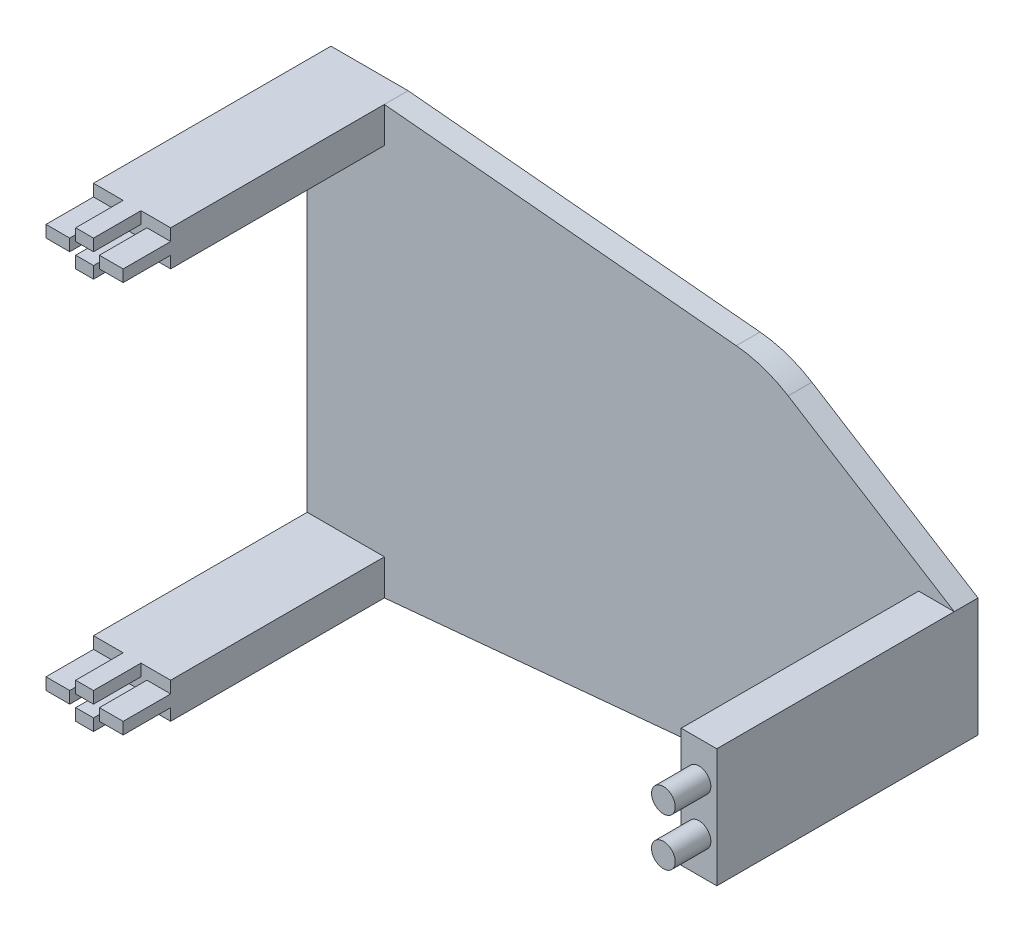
from build123d import *

# Parameters (mm, degrees)
SKETCH_1_W      = 38.5
SKETCH_1_H      = 30
EXTRUDE_1_DEPTH = 2
EXTRUDE_START   = -2
SKETCH_3_W      = 6.5
SKETCH_3_H      = 3
EXTRUDE_2_DEPTH = 20
SKETCH_4_W      = 2
SKETCH_4_H      = 1
SKETCH_4_W_2    = 1.5
EXTRUDE_3_DEPTH = 4
SKETCH_5_W      = 3
SKETCH_5_H      = 10
EXTRUDE_4_DEPTH = 20
SKETCH_6_R      = 1
EXTRUDE_5_DEPTH = 3
EXTRUDE_6_DEPTH = 2
FILLET_1_R      = 10


with BuildPart() as part:
    # Sketch 1 → Extrude 1 (new body)
    with BuildSketch(Plane.XY):
        Polygon((35.25, -5), (19.25, -15), (19.25, 15), (35.25, 5), align=None)
        Rectangle(SKETCH_1_W, SKETCH_1_H)
    extrude(amount=EXTRUDE_1_DEPTH)

    # Sketch 3 → Extrude 2 (add)
    with BuildSketch(Plane.XY.offset(2).offset(EXTRUDE_START)):
        with Locations((-16, 16.5)):
            Rectangle(SKETCH_3_W, SKETCH_3_H)
        with Locations((-16, -16.5)):
            Rectangle(SKETCH_3_W, SKETCH_3_H)
    extrude(amount=EXTRUDE_2_DEPTH)

    # Sketch 4 → Extrude 3 (add)
    with BuildSketch(Plane.XY.offset(20)):
        with Locations((-18.25, 16.5)):
            Rectangle(SKETCH_4_W, SKETCH_4_H)
        with Locations((-16, 17.5)):
            Rectangle(SKETCH_4_W_2, SKETCH_4_H)
        with Locations((-13.75, 16.5)):
            Rectangle(SKETCH_4_W, SKETCH_4_H)
        with Locations((-16, 15.5)):
            Rectangle(SKETCH_4_W_2, SKETCH_4_H)
    extrude_3 = extrude(amount=EXTRUDE_3_DEPTH)

    # Mirror 1: Extrude 3 across plane
    add(extrude_3.mirror(Plane.ZX))

    # Sketch 5 → Extrude 4 (add)
    with BuildSketch(Plane.XY.offset(2)):
        with Locations((33.75, 0)):
            Rectangle(SKETCH_5_W, SKETCH_5_H)
    extrude(amount=EXTRUDE_4_DEPTH)

    # Sketch 6 → Extrude 5 (add)
    with BuildSketch(Plane.XY.offset(22)):
        with Locations(Location((33.75, 2, 0), (0, 0, 180))):
            Circle(SKETCH_6_R)
        with Locations(Location((33.75, -2, 0), (0, 0, 180))):
            Circle(SKETCH_6_R)
    extrude(amount=EXTRUDE_5_DEPTH)

    # Sketch 7 → Extrude 6 (add)
    with BuildSketch(Plane.XY.offset(2)):
        Polygon((-12.75, 18), (19.25, 15), (-12.75, 15), align=None)
        Polygon((-12.75, -15), (19.25, -15), (-12.75, -18), align=None)
    extrude(amount=-EXTRUDE_6_DEPTH)

    # Fillet 1
    fillet_1_edges = [part.edges().sort_by_distance(p)[0] for p in [
        (19.25, -15, 1),
        (19.25, 15, 1),
    ]]
    fillet(fillet_1_edges, radius=FILLET_1_R)


solid = part.part
